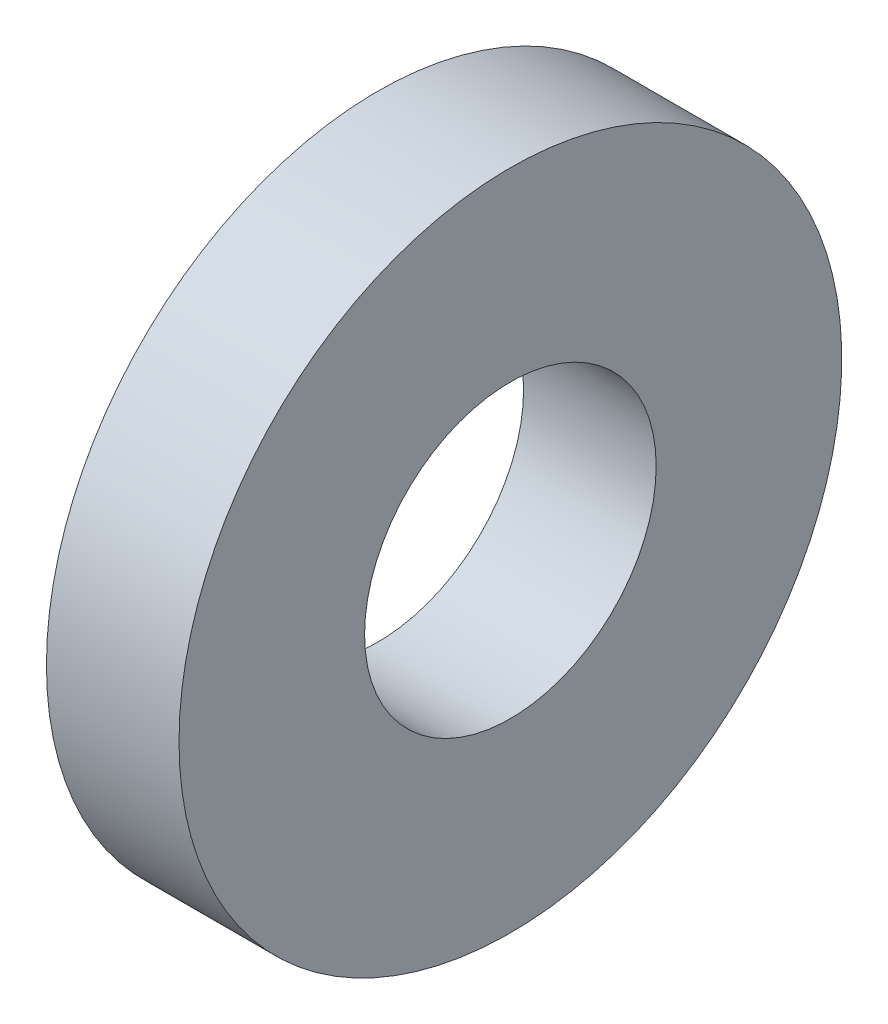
ISO-10303-21;
HEADER;
FILE_DESCRIPTION(('STEP AP214'),'2;1');
FILE_NAME('part.step','',(''),(''),'','','');
FILE_SCHEMA(('AUTOMOTIVE_DESIGN { 1 0 10303 214 1 1 1 1 }'));
ENDSEC;
DATA;
#1=APPLICATION_CONTEXT('core data for automotive mechanical design processes');
#2=APPLICATION_PROTOCOL_DEFINITION('international standard','automotive_design',2000,#1);
#3=PRODUCT_CONTEXT('',#1,'mechanical');
#4=PRODUCT('Part','Part','',(#3));
#5=PRODUCT_RELATED_PRODUCT_CATEGORY('part','',(#4));
#6=PRODUCT_DEFINITION_FORMATION('','',#4);
#7=PRODUCT_DEFINITION_CONTEXT('part definition',#1,'design');
#8=PRODUCT_DEFINITION('design','',#6,#7);
#9=PRODUCT_DEFINITION_SHAPE('','',#8);
#10=(LENGTH_UNIT() NAMED_UNIT(*) SI_UNIT(.MILLI.,.METRE.));
#11=(NAMED_UNIT(*) PLANE_ANGLE_UNIT() SI_UNIT($,.RADIAN.));
#12=(NAMED_UNIT(*) SI_UNIT($,.STERADIAN.) SOLID_ANGLE_UNIT());
#13=UNCERTAINTY_MEASURE_WITH_UNIT(LENGTH_MEASURE(1.E-05),#10,'distance_accuracy_value','');
#14=(GEOMETRIC_REPRESENTATION_CONTEXT(3) GLOBAL_UNCERTAINTY_ASSIGNED_CONTEXT((#13)) GLOBAL_UNIT_ASSIGNED_CONTEXT((#10,
#11,#12)) REPRESENTATION_CONTEXT('',''));
#15=CARTESIAN_POINT('',(0.,0.,0.));
#16=DIRECTION('',(0.,0.,1.));
#17=DIRECTION('',(1.,0.,0.));
#18=AXIS2_PLACEMENT_3D('',#15,#16,#17);
#19=CARTESIAN_POINT('',(-26.1,0.,0.));
#20=DIRECTION('',(-1.,0.,0.));
#21=DIRECTION('',(0.,0.,1.));
#22=AXIS2_PLACEMENT_3D('',#19,#20,#21);
#23=PLANE('',#22);
#24=CARTESIAN_POINT('',(-26.1,0.,0.));
#25=DIRECTION('',(-1.,0.,0.));
#26=DIRECTION('',(0.,0.,1.));
#27=AXIS2_PLACEMENT_3D('',#24,#25,#26);
#28=CIRCLE('',#27,4.28581978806);
#29=CARTESIAN_POINT('',(-26.1,0.,4.28581978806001));
#30=VERTEX_POINT('',#29);
#31=EDGE_CURVE('E40',#30,#30,#28,.T.);
#32=ORIENTED_EDGE('',*,*,#31,.F.);
#33=EDGE_LOOP('',(#32));
#34=FACE_BOUND('',#33,.T.);
#35=CARTESIAN_POINT('',(-26.1,0.,0.));
#36=DIRECTION('',(-1.,0.,0.));
#37=DIRECTION('',(0.,0.,1.));
#38=AXIS2_PLACEMENT_3D('',#35,#36,#37);
#39=CIRCLE('',#38,6.66816561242);
#40=CARTESIAN_POINT('',(-26.1,0.,6.66816561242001));
#41=VERTEX_POINT('',#40);
#42=EDGE_CURVE('E18',#41,#41,#39,.T.);
#43=ORIENTED_EDGE('',*,*,#42,.T.);
#44=EDGE_LOOP('',(#43));
#45=FACE_BOUND('',#44,.T.);
#46=ADVANCED_FACE('F15',(#34,#45),#23,.T.);
#47=CARTESIAN_POINT('',(-26.35,0.,0.));
#48=DIRECTION('',(-1.,0.,0.));
#49=DIRECTION('',(0.,0.,1.));
#50=AXIS2_PLACEMENT_3D('',#47,#48,#49);
#51=CYLINDRICAL_SURFACE('',#50,6.66816561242);
#52=CARTESIAN_POINT('',(-26.6,0.,0.));
#53=DIRECTION('',(-1.,0.,0.));
#54=DIRECTION('',(0.,0.,1.));
#55=AXIS2_PLACEMENT_3D('',#52,#53,#54);
#56=CIRCLE('',#55,6.66816561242);
#57=CARTESIAN_POINT('',(-26.6,0.,6.66816561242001));
#58=VERTEX_POINT('',#57);
#59=EDGE_CURVE('E38',#58,#58,#56,.F.);
#60=ORIENTED_EDGE('',*,*,#59,.F.);
#61=EDGE_LOOP('',(#60));
#62=FACE_BOUND('',#61,.T.);
#63=ORIENTED_EDGE('',*,*,#42,.F.);
#64=EDGE_LOOP('',(#63));
#65=FACE_BOUND('',#64,.T.);
#66=ADVANCED_FACE('F48',(#62,#65),#51,.F.);
#67=CARTESIAN_POINT('',(-26.35,0.,0.));
#68=DIRECTION('',(-1.,0.,0.));
#69=DIRECTION('',(0.,0.,1.));
#70=AXIS2_PLACEMENT_3D('',#67,#68,#69);
#71=CYLINDRICAL_SURFACE('',#70,4.28581978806);
#72=CARTESIAN_POINT('',(-26.6,0.,0.));
#73=DIRECTION('',(-1.,0.,0.));
#74=DIRECTION('',(0.,0.,1.));
#75=AXIS2_PLACEMENT_3D('',#72,#73,#74);
#76=CIRCLE('',#75,4.28581978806);
#77=CARTESIAN_POINT('',(-26.6,0.,4.28581978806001));
#78=VERTEX_POINT('',#77);
#79=EDGE_CURVE('E35',#78,#78,#76,.T.);
#80=ORIENTED_EDGE('',*,*,#79,.F.);
#81=EDGE_LOOP('',(#80));
#82=FACE_BOUND('',#81,.T.);
#83=ORIENTED_EDGE('',*,*,#31,.T.);
#84=EDGE_LOOP('',(#83));
#85=FACE_BOUND('',#84,.T.);
#86=ADVANCED_FACE('F50',(#82,#85),#71,.T.);
#87=CARTESIAN_POINT('',(-26.6,0.,0.));
#88=DIRECTION('',(-1.,0.,0.));
#89=DIRECTION('',(0.,0.,1.));
#90=AXIS2_PLACEMENT_3D('',#87,#88,#89);
#91=PLANE('',#90);
#92=ORIENTED_EDGE('',*,*,#59,.T.);
#93=EDGE_LOOP('',(#92));
#94=FACE_BOUND('',#93,.T.);
#95=CARTESIAN_POINT('',(-26.6,0.,0.));
#96=DIRECTION('',(-1.,0.,0.));
#97=DIRECTION('',(0.,0.,1.));
#98=AXIS2_PLACEMENT_3D('',#95,#96,#97);
#99=CIRCLE('',#98,7.5);
#100=CARTESIAN_POINT('',(-26.6,0.,7.50000000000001));
#101=VERTEX_POINT('',#100);
#102=EDGE_CURVE('E32',#101,#101,#99,.F.);
#103=ORIENTED_EDGE('',*,*,#102,.F.);
#104=EDGE_LOOP('',(#103));
#105=FACE_BOUND('',#104,.T.);
#106=ADVANCED_FACE('F57',(#94,#105),#91,.T.);
#107=CARTESIAN_POINT('',(-26.6,0.,0.));
#108=DIRECTION('',(-1.,0.,0.));
#109=DIRECTION('',(0.,0.,1.));
#110=AXIS2_PLACEMENT_3D('',#107,#108,#109);
#111=PLANE('',#110);
#112=CARTESIAN_POINT('',(-26.6,0.,0.));
#113=DIRECTION('',(-1.,0.,0.));
#114=DIRECTION('',(0.,0.,1.));
#115=AXIS2_PLACEMENT_3D('',#112,#113,#114);
#116=CIRCLE('',#115,3.3);
#117=CARTESIAN_POINT('',(-26.6,0.,3.30000000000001));
#118=VERTEX_POINT('',#117);
#119=EDGE_CURVE('E27',#118,#118,#116,.F.);
#120=ORIENTED_EDGE('',*,*,#119,.T.);
#121=EDGE_LOOP('',(#120));
#122=FACE_BOUND('',#121,.T.);
#123=ORIENTED_EDGE('',*,*,#79,.T.);
#124=EDGE_LOOP('',(#123));
#125=FACE_BOUND('',#124,.T.);
#126=ADVANCED_FACE('F77',(#122,#125),#111,.T.);
#127=CARTESIAN_POINT('',(-25.1,0.,0.));
#128=DIRECTION('',(-1.,0.,0.));
#129=DIRECTION('',(0.,0.,1.));
#130=AXIS2_PLACEMENT_3D('',#127,#128,#129);
#131=CYLINDRICAL_SURFACE('',#130,7.5);
#132=ORIENTED_EDGE('',*,*,#102,.T.);
#133=EDGE_LOOP('',(#132));
#134=FACE_BOUND('',#133,.T.);
#135=CARTESIAN_POINT('',(-23.6,0.,0.));
#136=DIRECTION('',(-1.,0.,0.));
#137=DIRECTION('',(0.,0.,1.));
#138=AXIS2_PLACEMENT_3D('',#135,#136,#137);
#139=CIRCLE('',#138,7.5);
#140=CARTESIAN_POINT('',(-23.6,0.,7.5));
#141=VERTEX_POINT('',#140);
#142=EDGE_CURVE('E22',#141,#141,#139,.T.);
#143=ORIENTED_EDGE('',*,*,#142,.T.);
#144=EDGE_LOOP('',(#143));
#145=FACE_BOUND('',#144,.T.);
#146=ADVANCED_FACE('F70',(#134,#145),#131,.T.);
#147=CARTESIAN_POINT('',(-25.1,0.,0.));
#148=DIRECTION('',(-1.,0.,0.));
#149=DIRECTION('',(0.,0.,1.));
#150=AXIS2_PLACEMENT_3D('',#147,#148,#149);
#151=CYLINDRICAL_SURFACE('',#150,3.3);
#152=ORIENTED_EDGE('',*,*,#119,.F.);
#153=EDGE_LOOP('',(#152));
#154=FACE_BOUND('',#153,.T.);
#155=CARTESIAN_POINT('',(-23.6,0.,0.));
#156=DIRECTION('',(-1.,0.,0.));
#157=DIRECTION('',(0.,0.,1.));
#158=AXIS2_PLACEMENT_3D('',#155,#156,#157);
#159=CIRCLE('',#158,3.3);
#160=CARTESIAN_POINT('',(-23.6,0.,3.3));
#161=VERTEX_POINT('',#160);
#162=EDGE_CURVE('E10',#161,#161,#159,.F.);
#163=ORIENTED_EDGE('',*,*,#162,.T.);
#164=EDGE_LOOP('',(#163));
#165=FACE_BOUND('',#164,.T.);
#166=ADVANCED_FACE('F64',(#154,#165),#151,.F.);
#167=CARTESIAN_POINT('',(-23.6,0.,0.));
#168=DIRECTION('',(-1.,0.,0.));
#169=DIRECTION('',(0.,0.,1.));
#170=AXIS2_PLACEMENT_3D('',#167,#168,#169);
#171=PLANE('',#170);
#172=ORIENTED_EDGE('',*,*,#162,.F.);
#173=EDGE_LOOP('',(#172));
#174=FACE_BOUND('',#173,.T.);
#175=ORIENTED_EDGE('',*,*,#142,.F.);
#176=EDGE_LOOP('',(#175));
#177=FACE_BOUND('',#176,.T.);
#178=ADVANCED_FACE('F62',(#174,#177),#171,.F.);
#179=CLOSED_SHELL('',(#46,#66,#86,#106,#126,#146,#166,#178));
#180=MANIFOLD_SOLID_BREP('B1',#179);
#181=ADVANCED_BREP_SHAPE_REPRESENTATION('',(#18,#180),#14);
#182=SHAPE_DEFINITION_REPRESENTATION(#9,#181);
ENDSEC;
END-ISO-10303-21;
